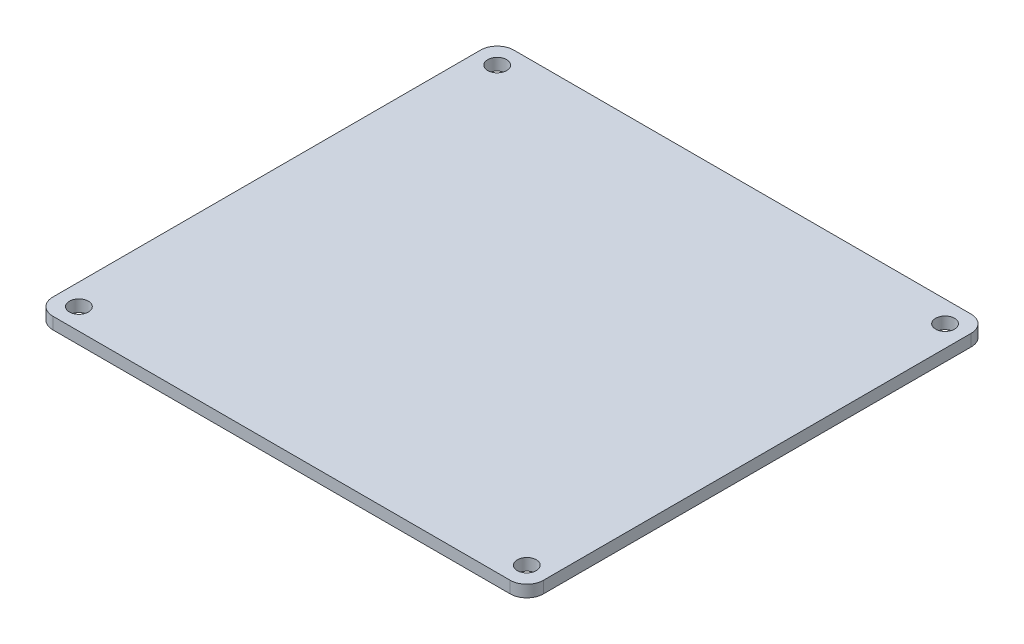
from build123d import *

# Parameters (mm, degrees)
ESQUISSE1_R      = 1.6
EXTRUSION1_DEPTH = 2


with BuildPart() as part:
    # Esquisse1 → Extrusion1 (new body)
    with BuildSketch(Plane(origin=(0, 0, 0), x_dir=(1, 0, 0), z_dir=(0, 1, 0))):
        with BuildLine():
            Line((2.8, 77.8), (80, 77.8))
            ThreePointArc((80, 77.8), (81.979898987, 76.979898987), (82.8, 75))
            Line((82.8, 75), (82.8, 2.8))
            ThreePointArc((82.8, 2.8), (81.979898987, 0.820101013), (80, 0))
            Line((80, 0), (2.8, 0))
            ThreePointArc((2.8, 0), (0.820101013, 0.820101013), (0, 2.8))
            Line((0, 2.8), (0, 75))
            ThreePointArc((0, 75), (0.820101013, 76.979898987), (2.8, 77.8))
        make_face()
        with Locations(Location((3.6, 3.6, 0), (0, 0, 270))):
            Circle(ESQUISSE1_R, mode=Mode.SUBTRACT)
        with Locations(Location((79.2, 3.6, 0), (0, 0, 90))):
            Circle(ESQUISSE1_R, mode=Mode.SUBTRACT)
        with Locations(Location((79.2, 74.2, 0), (0, 0, 270))):
            Circle(ESQUISSE1_R, mode=Mode.SUBTRACT)
        with Locations(Location((3.6, 74.2, 0), (0, 0, 90))):
            Circle(ESQUISSE1_R, mode=Mode.SUBTRACT)
    extrude(amount=EXTRUSION1_DEPTH)


solid = part.part
